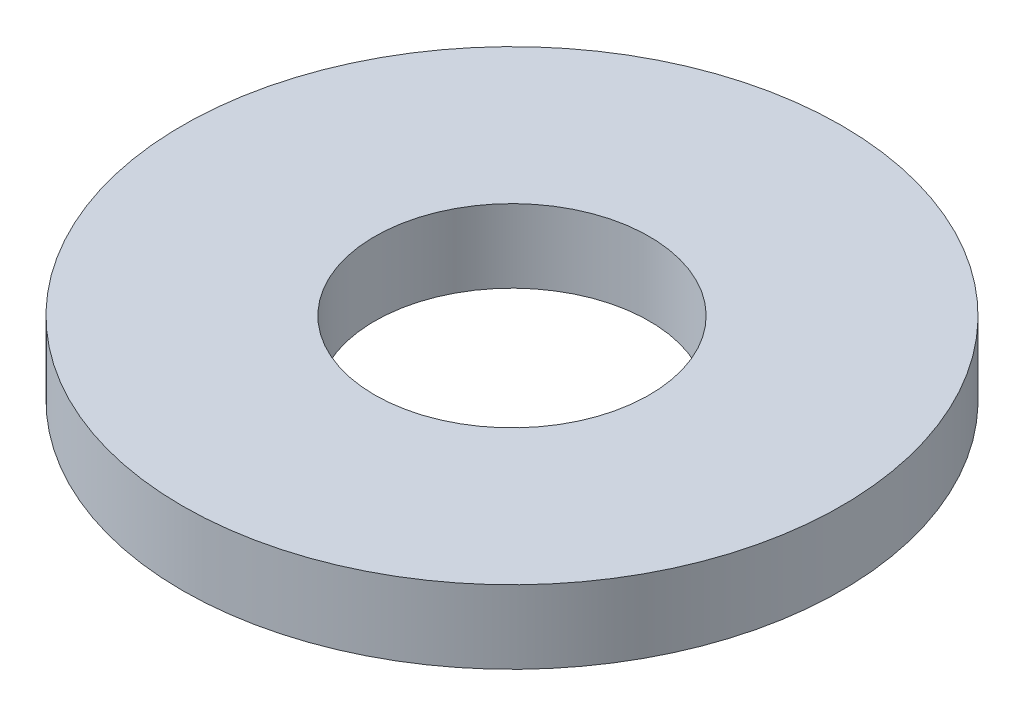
ISO-10303-21;
HEADER;
FILE_DESCRIPTION(('STEP AP214'),'2;1');
FILE_NAME('part.step','',(''),(''),'','','');
FILE_SCHEMA(('AUTOMOTIVE_DESIGN { 1 0 10303 214 1 1 1 1 }'));
ENDSEC;
DATA;
#1=APPLICATION_CONTEXT('core data for automotive mechanical design processes');
#2=APPLICATION_PROTOCOL_DEFINITION('international standard','automotive_design',2000,#1);
#3=PRODUCT_CONTEXT('',#1,'mechanical');
#4=PRODUCT('Part','Part','',(#3));
#5=PRODUCT_RELATED_PRODUCT_CATEGORY('part','',(#4));
#6=PRODUCT_DEFINITION_FORMATION('','',#4);
#7=PRODUCT_DEFINITION_CONTEXT('part definition',#1,'design');
#8=PRODUCT_DEFINITION('design','',#6,#7);
#9=PRODUCT_DEFINITION_SHAPE('','',#8);
#10=(LENGTH_UNIT() NAMED_UNIT(*) SI_UNIT(.MILLI.,.METRE.));
#11=(NAMED_UNIT(*) PLANE_ANGLE_UNIT() SI_UNIT($,.RADIAN.));
#12=(NAMED_UNIT(*) SI_UNIT($,.STERADIAN.) SOLID_ANGLE_UNIT());
#13=UNCERTAINTY_MEASURE_WITH_UNIT(LENGTH_MEASURE(1.E-05),#10,'distance_accuracy_value','');
#14=(GEOMETRIC_REPRESENTATION_CONTEXT(3) GLOBAL_UNCERTAINTY_ASSIGNED_CONTEXT((#13)) GLOBAL_UNIT_ASSIGNED_CONTEXT((#10,
#11,#12)) REPRESENTATION_CONTEXT('',''));
#15=CARTESIAN_POINT('',(0.,0.,0.));
#16=DIRECTION('',(0.,0.,1.));
#17=DIRECTION('',(1.,0.,0.));
#18=AXIS2_PLACEMENT_3D('',#15,#16,#17);
#19=CARTESIAN_POINT('',(0.,2.54,0.));
#20=DIRECTION('',(0.,1.,0.));
#21=DIRECTION('',(0.,0.,1.));
#22=AXIS2_PLACEMENT_3D('',#19,#20,#21);
#23=PLANE('',#22);
#24=CARTESIAN_POINT('',(0.,2.54,0.));
#25=DIRECTION('',(0.,1.,0.));
#26=DIRECTION('',(0.,0.,1.));
#27=AXIS2_PLACEMENT_3D('',#24,#25,#26);
#28=CIRCLE('',#27,11.43);
#29=CARTESIAN_POINT('',(0.,2.54,11.43));
#30=VERTEX_POINT('',#29);
#31=EDGE_CURVE('E10',#30,#30,#28,.T.);
#32=ORIENTED_EDGE('',*,*,#31,.T.);
#33=EDGE_LOOP('',(#32));
#34=FACE_BOUND('',#33,.T.);
#35=CARTESIAN_POINT('',(0.,2.54,0.));
#36=DIRECTION('',(0.,1.,0.));
#37=DIRECTION('',(0.,0.,1.));
#38=AXIS2_PLACEMENT_3D('',#35,#36,#37);
#39=CIRCLE('',#38,4.7625);
#40=CARTESIAN_POINT('',(0.,2.54,4.7625));
#41=VERTEX_POINT('',#40);
#42=EDGE_CURVE('E35',#41,#41,#39,.T.);
#43=ORIENTED_EDGE('',*,*,#42,.F.);
#44=EDGE_LOOP('',(#43));
#45=FACE_BOUND('',#44,.T.);
#46=ADVANCED_FACE('F24',(#34,#45),#23,.T.);
#47=CARTESIAN_POINT('',(0.,0.,0.));
#48=DIRECTION('',(0.,1.,0.));
#49=DIRECTION('',(0.,0.,1.));
#50=AXIS2_PLACEMENT_3D('',#47,#48,#49);
#51=PLANE('',#50);
#52=CARTESIAN_POINT('',(0.,0.,0.));
#53=DIRECTION('',(0.,1.,0.));
#54=DIRECTION('',(0.,0.,1.));
#55=AXIS2_PLACEMENT_3D('',#52,#53,#54);
#56=CIRCLE('',#55,11.43);
#57=CARTESIAN_POINT('',(0.,0.,11.43));
#58=VERTEX_POINT('',#57);
#59=EDGE_CURVE('E31',#58,#58,#56,.T.);
#60=ORIENTED_EDGE('',*,*,#59,.F.);
#61=EDGE_LOOP('',(#60));
#62=FACE_BOUND('',#61,.T.);
#63=CARTESIAN_POINT('',(0.,0.,0.));
#64=DIRECTION('',(0.,1.,0.));
#65=DIRECTION('',(0.,0.,1.));
#66=AXIS2_PLACEMENT_3D('',#63,#64,#65);
#67=CIRCLE('',#66,4.7625);
#68=CARTESIAN_POINT('',(0.,0.,4.7625));
#69=VERTEX_POINT('',#68);
#70=EDGE_CURVE('E39',#69,#69,#67,.T.);
#71=ORIENTED_EDGE('',*,*,#70,.T.);
#72=EDGE_LOOP('',(#71));
#73=FACE_BOUND('',#72,.T.);
#74=ADVANCED_FACE('F45',(#62,#73),#51,.F.);
#75=CARTESIAN_POINT('',(0.,2.54,0.));
#76=DIRECTION('',(0.,-1.,0.));
#77=DIRECTION('',(0.,0.,-1.));
#78=AXIS2_PLACEMENT_3D('',#75,#76,#77);
#79=CYLINDRICAL_SURFACE('',#78,11.43);
#80=ORIENTED_EDGE('',*,*,#31,.F.);
#81=EDGE_LOOP('',(#80));
#82=FACE_BOUND('',#81,.T.);
#83=ORIENTED_EDGE('',*,*,#59,.T.);
#84=EDGE_LOOP('',(#83));
#85=FACE_BOUND('',#84,.T.);
#86=ADVANCED_FACE('F26',(#82,#85),#79,.T.);
#87=CARTESIAN_POINT('',(0.,2.54,0.));
#88=DIRECTION('',(0.,-1.,0.));
#89=DIRECTION('',(0.,0.,-1.));
#90=AXIS2_PLACEMENT_3D('',#87,#88,#89);
#91=CYLINDRICAL_SURFACE('',#90,4.7625);
#92=ORIENTED_EDGE('',*,*,#42,.T.);
#93=EDGE_LOOP('',(#92));
#94=FACE_BOUND('',#93,.T.);
#95=ORIENTED_EDGE('',*,*,#70,.F.);
#96=EDGE_LOOP('',(#95));
#97=FACE_BOUND('',#96,.T.);
#98=ADVANCED_FACE('F47',(#94,#97),#91,.F.);
#99=CLOSED_SHELL('',(#46,#74,#86,#98));
#100=MANIFOLD_SOLID_BREP('B2',#99);
#101=ADVANCED_BREP_SHAPE_REPRESENTATION('',(#18,#100),#14);
#102=SHAPE_DEFINITION_REPRESENTATION(#9,#101);
ENDSEC;
END-ISO-10303-21;
